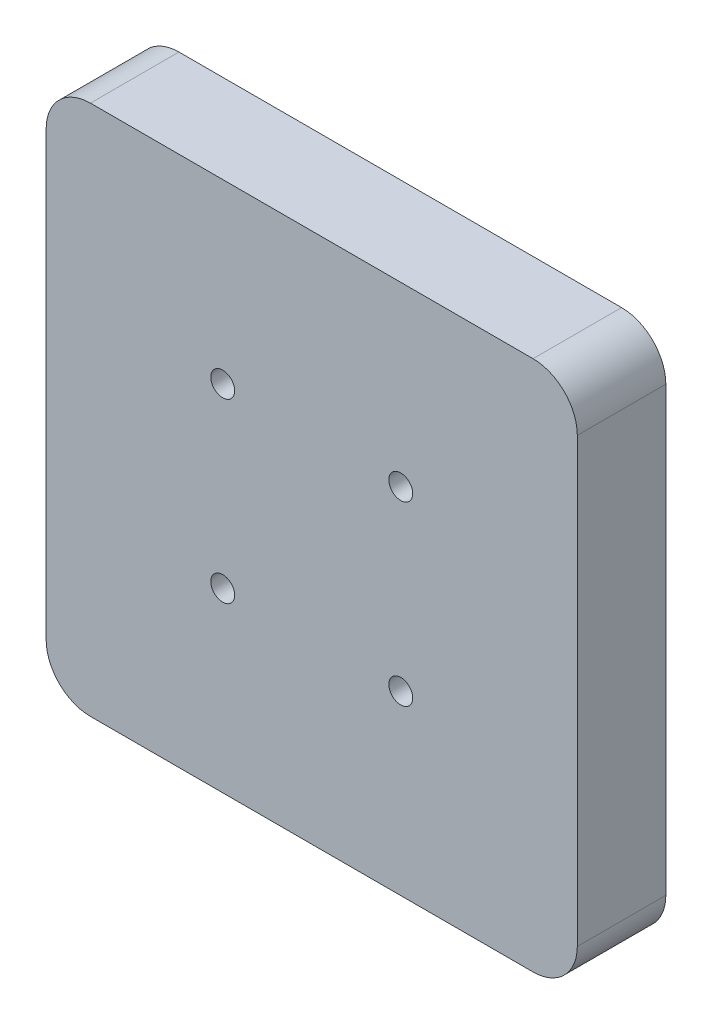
ISO-10303-21;
HEADER;
FILE_DESCRIPTION(('STEP AP214'),'2;1');
FILE_NAME('part.step','',(''),(''),'','','');
FILE_SCHEMA(('AUTOMOTIVE_DESIGN { 1 0 10303 214 1 1 1 1 }'));
ENDSEC;
DATA;
#1=APPLICATION_CONTEXT('core data for automotive mechanical design processes');
#2=APPLICATION_PROTOCOL_DEFINITION('international standard','automotive_design',2000,#1);
#3=PRODUCT_CONTEXT('',#1,'mechanical');
#4=PRODUCT('Part','Part','',(#3));
#5=PRODUCT_RELATED_PRODUCT_CATEGORY('part','',(#4));
#6=PRODUCT_DEFINITION_FORMATION('','',#4);
#7=PRODUCT_DEFINITION_CONTEXT('part definition',#1,'design');
#8=PRODUCT_DEFINITION('design','',#6,#7);
#9=PRODUCT_DEFINITION_SHAPE('','',#8);
#10=(LENGTH_UNIT() NAMED_UNIT(*) SI_UNIT(.MILLI.,.METRE.));
#11=(NAMED_UNIT(*) PLANE_ANGLE_UNIT() SI_UNIT($,.RADIAN.));
#12=(NAMED_UNIT(*) SI_UNIT($,.STERADIAN.) SOLID_ANGLE_UNIT());
#13=UNCERTAINTY_MEASURE_WITH_UNIT(LENGTH_MEASURE(1.E-05),#10,'distance_accuracy_value','');
#14=(GEOMETRIC_REPRESENTATION_CONTEXT(3) GLOBAL_UNCERTAINTY_ASSIGNED_CONTEXT((#13)) GLOBAL_UNIT_ASSIGNED_CONTEXT((#10,
#11,#12)) REPRESENTATION_CONTEXT('',''));
#15=CARTESIAN_POINT('',(0.,0.,0.));
#16=DIRECTION('',(0.,0.,1.));
#17=DIRECTION('',(1.,0.,0.));
#18=AXIS2_PLACEMENT_3D('',#15,#16,#17);
#19=CARTESIAN_POINT('',(0.,0.,0.));
#20=DIRECTION('',(0.,0.,1.));
#21=DIRECTION('',(1.,0.,0.));
#22=AXIS2_PLACEMENT_3D('',#19,#20,#21);
#23=PLANE('',#22);
#24=CARTESIAN_POINT('',(10.113345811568,-73.4041602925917,0.));
#25=DIRECTION('',(0.,0.,1.));
#26=DIRECTION('',(1.,0.,0.));
#27=AXIS2_PLACEMENT_3D('',#24,#25,#26);
#28=CIRCLE('',#27,2.7);
#29=CARTESIAN_POINT('',(12.813345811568,-73.4041602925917,0.));
#30=VERTEX_POINT('',#29);
#31=EDGE_CURVE('E379',#30,#30,#28,.T.);
#32=ORIENTED_EDGE('',*,*,#31,.T.);
#33=EDGE_LOOP('',(#32));
#34=FACE_BOUND('',#33,.T.);
#35=CARTESIAN_POINT('',(10.113345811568,-73.4041602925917,0.));
#36=DIRECTION('',(0.,0.,-1.));
#37=DIRECTION('',(-1.,0.,0.));
#38=AXIS2_PLACEMENT_3D('',#35,#36,#37);
#39=CIRCLE('',#38,5.);
#40=CARTESIAN_POINT('',(5.11334581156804,-73.4041602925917,0.));
#41=VERTEX_POINT('',#40);
#42=EDGE_CURVE('E355',#41,#41,#39,.T.);
#43=ORIENTED_EDGE('',*,*,#42,.T.);
#44=EDGE_LOOP('',(#43));
#45=FACE_BOUND('',#44,.T.);
#46=ADVANCED_FACE('F45',(#34,#45),#23,.F.);
#47=CARTESIAN_POINT('',(-30.1133458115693,-73.4041602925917,0.));
#48=DIRECTION('',(0.,0.,1.));
#49=DIRECTION('',(1.,0.,0.));
#50=AXIS2_PLACEMENT_3D('',#47,#48,#49);
#51=CIRCLE('',#50,2.7);
#52=CARTESIAN_POINT('',(-27.4133458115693,-73.4041602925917,0.));
#53=VERTEX_POINT('',#52);
#54=EDGE_CURVE('E387',#53,#53,#51,.T.);
#55=ORIENTED_EDGE('',*,*,#54,.T.);
#56=EDGE_LOOP('',(#55));
#57=FACE_BOUND('',#56,.T.);
#58=CARTESIAN_POINT('',(-30.1133458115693,-73.4041602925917,0.));
#59=DIRECTION('',(0.,0.,-1.));
#60=DIRECTION('',(-1.,0.,0.));
#61=AXIS2_PLACEMENT_3D('',#58,#59,#60);
#62=CIRCLE('',#61,5.00000000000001);
#63=CARTESIAN_POINT('',(-35.1133458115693,-73.4041602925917,0.));
#64=VERTEX_POINT('',#63);
#65=EDGE_CURVE('E347',#64,#64,#62,.T.);
#66=ORIENTED_EDGE('',*,*,#65,.T.);
#67=EDGE_LOOP('',(#66));
#68=FACE_BOUND('',#67,.T.);
#69=ADVANCED_FACE('F448',(#57,#68),#23,.F.);
#70=CARTESIAN_POINT('',(-30.1133458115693,-113.404160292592,0.));
#71=DIRECTION('',(0.,0.,1.));
#72=DIRECTION('',(1.,0.,0.));
#73=AXIS2_PLACEMENT_3D('',#70,#71,#72);
#74=CIRCLE('',#73,2.70000000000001);
#75=CARTESIAN_POINT('',(-27.4133458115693,-113.404160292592,0.));
#76=VERTEX_POINT('',#75);
#77=EDGE_CURVE('E363',#76,#76,#74,.T.);
#78=ORIENTED_EDGE('',*,*,#77,.T.);
#79=EDGE_LOOP('',(#78));
#80=FACE_BOUND('',#79,.T.);
#81=CARTESIAN_POINT('',(-30.1133458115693,-113.404160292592,0.));
#82=DIRECTION('',(0.,0.,-1.));
#83=DIRECTION('',(-1.,0.,0.));
#84=AXIS2_PLACEMENT_3D('',#81,#82,#83);
#85=CIRCLE('',#84,5.00000000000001);
#86=CARTESIAN_POINT('',(-35.1133458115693,-113.404160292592,0.));
#87=VERTEX_POINT('',#86);
#88=EDGE_CURVE('E339',#87,#87,#85,.T.);
#89=ORIENTED_EDGE('',*,*,#88,.T.);
#90=EDGE_LOOP('',(#89));
#91=FACE_BOUND('',#90,.T.);
#92=ADVANCED_FACE('F456',(#80,#91),#23,.F.);
#93=CARTESIAN_POINT('',(10.1133458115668,-113.404160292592,0.));
#94=DIRECTION('',(0.,0.,1.));
#95=DIRECTION('',(1.,0.,0.));
#96=AXIS2_PLACEMENT_3D('',#93,#94,#95);
#97=CIRCLE('',#96,2.70000000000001);
#98=CARTESIAN_POINT('',(12.8133458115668,-113.404160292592,0.));
#99=VERTEX_POINT('',#98);
#100=EDGE_CURVE('E371',#99,#99,#97,.T.);
#101=ORIENTED_EDGE('',*,*,#100,.T.);
#102=EDGE_LOOP('',(#101));
#103=FACE_BOUND('',#102,.T.);
#104=CARTESIAN_POINT('',(10.1133458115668,-113.404160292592,0.));
#105=DIRECTION('',(0.,0.,-1.));
#106=DIRECTION('',(-1.,0.,0.));
#107=AXIS2_PLACEMENT_3D('',#104,#105,#106);
#108=CIRCLE('',#107,5.);
#109=CARTESIAN_POINT('',(5.11334581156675,-113.404160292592,0.));
#110=VERTEX_POINT('',#109);
#111=EDGE_CURVE('E334',#110,#110,#108,.T.);
#112=ORIENTED_EDGE('',*,*,#111,.T.);
#113=EDGE_LOOP('',(#112));
#114=FACE_BOUND('',#113,.T.);
#115=ADVANCED_FACE('F451',(#103,#114),#23,.F.);
#116=CARTESIAN_POINT('',(0.,0.,6.));
#117=DIRECTION('',(0.,0.,1.));
#118=DIRECTION('',(1.,0.,0.));
#119=AXIS2_PLACEMENT_3D('',#116,#117,#118);
#120=PLANE('',#119);
#121=CARTESIAN_POINT('',(10.1133458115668,-113.404160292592,6.));
#122=DIRECTION('',(0.,0.,1.));
#123=DIRECTION('',(1.,0.,0.));
#124=AXIS2_PLACEMENT_3D('',#121,#122,#123);
#125=CIRCLE('',#124,2.70000000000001);
#126=CARTESIAN_POINT('',(12.8133458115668,-113.404160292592,6.));
#127=VERTEX_POINT('',#126);
#128=EDGE_CURVE('E375',#127,#127,#125,.T.);
#129=ORIENTED_EDGE('',*,*,#128,.F.);
#130=EDGE_LOOP('',(#129));
#131=FACE_BOUND('',#130,.T.);
#132=CARTESIAN_POINT('',(-30.1133458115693,-73.4041602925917,6.));
#133=DIRECTION('',(0.,0.,1.));
#134=DIRECTION('',(1.,0.,0.));
#135=AXIS2_PLACEMENT_3D('',#132,#133,#134);
#136=CIRCLE('',#135,2.7);
#137=CARTESIAN_POINT('',(-27.4133458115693,-73.4041602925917,6.));
#138=VERTEX_POINT('',#137);
#139=EDGE_CURVE('E391',#138,#138,#136,.T.);
#140=ORIENTED_EDGE('',*,*,#139,.F.);
#141=EDGE_LOOP('',(#140));
#142=FACE_BOUND('',#141,.T.);
#143=DIRECTION('',(0.,-1.,0.));
#144=VECTOR('',#143,1.);
#145=CARTESIAN_POINT('',(-70.0000000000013,-33.4041602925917,6.));
#146=LINE('',#145,#144);
#147=CARTESIAN_POINT('',(-70.0000000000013,-43.4041602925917,6.));
#148=VERTEX_POINT('',#147);
#149=CARTESIAN_POINT('',(-70.0000000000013,-143.404160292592,6.));
#150=VERTEX_POINT('',#149);
#151=EDGE_CURVE('E197',#148,#150,#146,.T.);
#152=ORIENTED_EDGE('',*,*,#151,.T.);
#153=CARTESIAN_POINT('',(-60.0000000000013,-143.404160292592,6.));
#154=DIRECTION('',(0.,0.,1.));
#155=DIRECTION('',(1.,0.,0.));
#156=AXIS2_PLACEMENT_3D('',#153,#154,#155);
#157=CIRCLE('',#156,10.);
#158=CARTESIAN_POINT('',(-60.0000000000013,-153.404160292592,6.));
#159=VERTEX_POINT('',#158);
#160=EDGE_CURVE('E261',#150,#159,#157,.T.);
#161=ORIENTED_EDGE('',*,*,#160,.T.);
#162=DIRECTION('',(1.,0.,0.));
#163=VECTOR('',#162,1.);
#164=CARTESIAN_POINT('',(-70.0000000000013,-153.404160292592,6.));
#165=LINE('',#164,#163);
#166=CARTESIAN_POINT('',(39.9999999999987,-153.404160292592,6.));
#167=VERTEX_POINT('',#166);
#168=EDGE_CURVE('E190',#159,#167,#165,.T.);
#169=ORIENTED_EDGE('',*,*,#168,.T.);
#170=CARTESIAN_POINT('',(39.9999999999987,-143.404160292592,6.));
#171=DIRECTION('',(0.,0.,1.));
#172=DIRECTION('',(1.,0.,0.));
#173=AXIS2_PLACEMENT_3D('',#170,#171,#172);
#174=CIRCLE('',#173,10.);
#175=CARTESIAN_POINT('',(49.9999999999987,-143.404160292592,6.));
#176=VERTEX_POINT('',#175);
#177=EDGE_CURVE('E253',#167,#176,#174,.T.);
#178=ORIENTED_EDGE('',*,*,#177,.T.);
#179=DIRECTION('',(0.,1.,0.));
#180=VECTOR('',#179,1.);
#181=CARTESIAN_POINT('',(49.9999999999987,-153.404160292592,6.));
#182=LINE('',#181,#180);
#183=CARTESIAN_POINT('',(49.9999999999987,-43.4041602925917,6.));
#184=VERTEX_POINT('',#183);
#185=EDGE_CURVE('E395',#176,#184,#182,.T.);
#186=ORIENTED_EDGE('',*,*,#185,.T.);
#187=CARTESIAN_POINT('',(39.9999999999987,-43.4041602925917,6.));
#188=DIRECTION('',(0.,0.,1.));
#189=DIRECTION('',(1.,0.,0.));
#190=AXIS2_PLACEMENT_3D('',#187,#188,#189);
#191=CIRCLE('',#190,10.);
#192=CARTESIAN_POINT('',(39.9999999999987,-33.4041602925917,6.));
#193=VERTEX_POINT('',#192);
#194=EDGE_CURVE('E68',#184,#193,#191,.T.);
#195=ORIENTED_EDGE('',*,*,#194,.T.);
#196=DIRECTION('',(-1.,0.,0.));
#197=VECTOR('',#196,1.);
#198=CARTESIAN_POINT('',(49.9999999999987,-33.4041602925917,6.));
#199=LINE('',#198,#197);
#200=CARTESIAN_POINT('',(-60.0000000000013,-33.4041602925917,6.));
#201=VERTEX_POINT('',#200);
#202=EDGE_CURVE('E401',#193,#201,#199,.T.);
#203=ORIENTED_EDGE('',*,*,#202,.T.);
#204=CARTESIAN_POINT('',(-60.0000000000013,-43.4041602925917,6.));
#205=DIRECTION('',(0.,0.,1.));
#206=DIRECTION('',(1.,0.,0.));
#207=AXIS2_PLACEMENT_3D('',#204,#205,#206);
#208=CIRCLE('',#207,10.);
#209=EDGE_CURVE('E258',#201,#148,#208,.T.);
#210=ORIENTED_EDGE('',*,*,#209,.T.);
#211=EDGE_LOOP('',(#152,#161,#169,#178,#186,#195,#203,#210));
#212=FACE_BOUND('',#211,.T.);
#213=CARTESIAN_POINT('',(10.113345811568,-73.4041602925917,6.));
#214=DIRECTION('',(0.,0.,1.));
#215=DIRECTION('',(1.,0.,0.));
#216=AXIS2_PLACEMENT_3D('',#213,#214,#215);
#217=CIRCLE('',#216,2.7);
#218=CARTESIAN_POINT('',(12.813345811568,-73.4041602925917,6.));
#219=VERTEX_POINT('',#218);
#220=EDGE_CURVE('E383',#219,#219,#217,.T.);
#221=ORIENTED_EDGE('',*,*,#220,.F.);
#222=EDGE_LOOP('',(#221));
#223=FACE_BOUND('',#222,.T.);
#224=CARTESIAN_POINT('',(-30.1133458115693,-113.404160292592,6.));
#225=DIRECTION('',(0.,0.,1.));
#226=DIRECTION('',(1.,0.,0.));
#227=AXIS2_PLACEMENT_3D('',#224,#225,#226);
#228=CIRCLE('',#227,2.70000000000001);
#229=CARTESIAN_POINT('',(-27.4133458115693,-113.404160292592,6.));
#230=VERTEX_POINT('',#229);
#231=EDGE_CURVE('E367',#230,#230,#228,.T.);
#232=ORIENTED_EDGE('',*,*,#231,.F.);
#233=EDGE_LOOP('',(#232));
#234=FACE_BOUND('',#233,.T.);
#235=ADVANCED_FACE('F407',(#131,#142,#212,#223,#234),#120,.T.);
#236=CARTESIAN_POINT('',(49.9999999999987,-93.4041602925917,6.));
#237=DIRECTION('',(-1.,0.,0.));
#238=DIRECTION('',(0.,0.,1.));
#239=AXIS2_PLACEMENT_3D('',#236,#237,#238);
#240=PLANE('',#239);
#241=DIRECTION('',(0.,-1.,0.));
#242=VECTOR('',#241,1.);
#243=CARTESIAN_POINT('',(49.9999999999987,-33.4041602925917,-14.));
#244=LINE('',#243,#242);
#245=CARTESIAN_POINT('',(49.9999999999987,-43.4041602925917,-14.));
#246=VERTEX_POINT('',#245);
#247=CARTESIAN_POINT('',(49.9999999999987,-143.404160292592,-14.));
#248=VERTEX_POINT('',#247);
#249=EDGE_CURVE('E330',#246,#248,#244,.T.);
#250=ORIENTED_EDGE('',*,*,#249,.F.);
#251=DIRECTION('',(0.,0.,-1.));
#252=VECTOR('',#251,1.);
#253=CARTESIAN_POINT('',(49.9999999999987,-43.4041602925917,6.));
#254=LINE('',#253,#252);
#255=EDGE_CURVE('E274',#246,#184,#254,.F.);
#256=ORIENTED_EDGE('',*,*,#255,.T.);
#257=ORIENTED_EDGE('',*,*,#185,.F.);
#258=DIRECTION('',(0.,0.,-1.));
#259=VECTOR('',#258,1.);
#260=CARTESIAN_POINT('',(49.9999999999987,-143.404160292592,6.));
#261=LINE('',#260,#259);
#262=EDGE_CURVE('E270',#176,#248,#261,.T.);
#263=ORIENTED_EDGE('',*,*,#262,.T.);
#264=EDGE_LOOP('',(#250,#256,#257,#263));
#265=FACE_BOUND('',#264,.T.);
#266=ADVANCED_FACE('F429',(#265),#240,.F.);
#267=CARTESIAN_POINT('',(49.9999999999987,-33.4041602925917,6.));
#268=DIRECTION('',(0.,-1.,0.));
#269=DIRECTION('',(0.,0.,-1.));
#270=AXIS2_PLACEMENT_3D('',#267,#268,#269);
#271=PLANE('',#270);
#272=DIRECTION('',(1.,0.,0.));
#273=VECTOR('',#272,1.);
#274=CARTESIAN_POINT('',(-70.0000000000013,-33.4041602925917,-14.));
#275=LINE('',#274,#273);
#276=CARTESIAN_POINT('',(-60.0000000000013,-33.4041602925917,-14.));
#277=VERTEX_POINT('',#276);
#278=CARTESIAN_POINT('',(39.9999999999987,-33.4041602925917,-14.));
#279=VERTEX_POINT('',#278);
#280=EDGE_CURVE('E326',#277,#279,#275,.T.);
#281=ORIENTED_EDGE('',*,*,#280,.F.);
#282=DIRECTION('',(0.,0.,-1.));
#283=VECTOR('',#282,1.);
#284=CARTESIAN_POINT('',(-60.0000000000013,-33.4041602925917,6.));
#285=LINE('',#284,#283);
#286=EDGE_CURVE('E61',#277,#201,#285,.F.);
#287=ORIENTED_EDGE('',*,*,#286,.T.);
#288=ORIENTED_EDGE('',*,*,#202,.F.);
#289=DIRECTION('',(0.,0.,-1.));
#290=VECTOR('',#289,1.);
#291=CARTESIAN_POINT('',(39.9999999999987,-33.4041602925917,6.));
#292=LINE('',#291,#290);
#293=EDGE_CURVE('E264',#193,#279,#292,.T.);
#294=ORIENTED_EDGE('',*,*,#293,.T.);
#295=EDGE_LOOP('',(#281,#287,#288,#294));
#296=FACE_BOUND('',#295,.T.);
#297=ADVANCED_FACE('F434',(#296),#271,.F.);
#298=CARTESIAN_POINT('',(-70.0000000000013,-33.4041602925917,6.));
#299=DIRECTION('',(1.,0.,0.));
#300=DIRECTION('',(0.,0.,-1.));
#301=AXIS2_PLACEMENT_3D('',#298,#299,#300);
#302=PLANE('',#301);
#303=DIRECTION('',(0.,1.,0.));
#304=VECTOR('',#303,1.);
#305=CARTESIAN_POINT('',(-70.0000000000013,-153.404160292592,-14.));
#306=LINE('',#305,#304);
#307=CARTESIAN_POINT('',(-70.0000000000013,-143.404160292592,-14.));
#308=VERTEX_POINT('',#307);
#309=CARTESIAN_POINT('',(-70.0000000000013,-43.4041602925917,-14.));
#310=VERTEX_POINT('',#309);
#311=EDGE_CURVE('E321',#308,#310,#306,.T.);
#312=ORIENTED_EDGE('',*,*,#311,.F.);
#313=DIRECTION('',(0.,0.,-1.));
#314=VECTOR('',#313,1.);
#315=CARTESIAN_POINT('',(-70.0000000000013,-143.404160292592,6.));
#316=LINE('',#315,#314);
#317=EDGE_CURVE('E250',#308,#150,#316,.F.);
#318=ORIENTED_EDGE('',*,*,#317,.T.);
#319=ORIENTED_EDGE('',*,*,#151,.F.);
#320=DIRECTION('',(0.,0.,-1.));
#321=VECTOR('',#320,1.);
#322=CARTESIAN_POINT('',(-70.0000000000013,-43.4041602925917,6.));
#323=LINE('',#322,#321);
#324=EDGE_CURVE('E246',#148,#310,#323,.T.);
#325=ORIENTED_EDGE('',*,*,#324,.T.);
#326=EDGE_LOOP('',(#312,#318,#319,#325));
#327=FACE_BOUND('',#326,.T.);
#328=ADVANCED_FACE('F437',(#327),#302,.F.);
#329=CARTESIAN_POINT('',(-70.0000000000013,-153.404160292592,6.));
#330=DIRECTION('',(0.,1.,0.));
#331=DIRECTION('',(0.,0.,1.));
#332=AXIS2_PLACEMENT_3D('',#329,#330,#331);
#333=PLANE('',#332);
#334=ORIENTED_EDGE('',*,*,#168,.F.);
#335=DIRECTION('',(0.,0.,-1.));
#336=VECTOR('',#335,1.);
#337=CARTESIAN_POINT('',(-60.0000000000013,-153.404160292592,6.));
#338=LINE('',#337,#336);
#339=CARTESIAN_POINT('',(-60.0000000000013,-153.404160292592,-14.));
#340=VERTEX_POINT('',#339);
#341=EDGE_CURVE('E230',#159,#340,#338,.T.);
#342=ORIENTED_EDGE('',*,*,#341,.T.);
#343=DIRECTION('',(-1.,0.,0.));
#344=VECTOR('',#343,1.);
#345=CARTESIAN_POINT('',(49.9999999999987,-153.404160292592,-14.));
#346=LINE('',#345,#344);
#347=CARTESIAN_POINT('',(39.9999999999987,-153.404160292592,-14.));
#348=VERTEX_POINT('',#347);
#349=EDGE_CURVE('E317',#348,#340,#346,.T.);
#350=ORIENTED_EDGE('',*,*,#349,.F.);
#351=DIRECTION('',(0.,0.,-1.));
#352=VECTOR('',#351,1.);
#353=CARTESIAN_POINT('',(39.9999999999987,-153.404160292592,6.));
#354=LINE('',#353,#352);
#355=EDGE_CURVE('E227',#348,#167,#354,.F.);
#356=ORIENTED_EDGE('',*,*,#355,.T.);
#357=EDGE_LOOP('',(#334,#342,#350,#356));
#358=FACE_BOUND('',#357,.T.);
#359=ADVANCED_FACE('F419',(#358),#333,.F.);
#360=CARTESIAN_POINT('',(-30.1133458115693,-73.4041602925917,6.));
#361=DIRECTION('',(0.,0.,-1.));
#362=DIRECTION('',(-1.,0.,0.));
#363=AXIS2_PLACEMENT_3D('',#360,#361,#362);
#364=CYLINDRICAL_SURFACE('',#363,2.7);
#365=ORIENTED_EDGE('',*,*,#139,.T.);
#366=EDGE_LOOP('',(#365));
#367=FACE_BOUND('',#366,.T.);
#368=ORIENTED_EDGE('',*,*,#54,.F.);
#369=EDGE_LOOP('',(#368));
#370=FACE_BOUND('',#369,.T.);
#371=ADVANCED_FACE('F444',(#367,#370),#364,.F.);
#372=CARTESIAN_POINT('',(10.113345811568,-73.4041602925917,6.));
#373=DIRECTION('',(0.,0.,-1.));
#374=DIRECTION('',(-1.,0.,0.));
#375=AXIS2_PLACEMENT_3D('',#372,#373,#374);
#376=CYLINDRICAL_SURFACE('',#375,2.7);
#377=ORIENTED_EDGE('',*,*,#220,.T.);
#378=EDGE_LOOP('',(#377));
#379=FACE_BOUND('',#378,.T.);
#380=ORIENTED_EDGE('',*,*,#31,.F.);
#381=EDGE_LOOP('',(#380));
#382=FACE_BOUND('',#381,.T.);
#383=ADVANCED_FACE('F502',(#379,#382),#376,.F.);
#384=CARTESIAN_POINT('',(10.1133458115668,-113.404160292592,6.));
#385=DIRECTION('',(0.,0.,-1.));
#386=DIRECTION('',(-1.,0.,0.));
#387=AXIS2_PLACEMENT_3D('',#384,#385,#386);
#388=CYLINDRICAL_SURFACE('',#387,2.70000000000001);
#389=ORIENTED_EDGE('',*,*,#128,.T.);
#390=EDGE_LOOP('',(#389));
#391=FACE_BOUND('',#390,.T.);
#392=ORIENTED_EDGE('',*,*,#100,.F.);
#393=EDGE_LOOP('',(#392));
#394=FACE_BOUND('',#393,.T.);
#395=ADVANCED_FACE('F498',(#391,#394),#388,.F.);
#396=CARTESIAN_POINT('',(-30.1133458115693,-113.404160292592,6.));
#397=DIRECTION('',(0.,0.,-1.));
#398=DIRECTION('',(-1.,0.,0.));
#399=AXIS2_PLACEMENT_3D('',#396,#397,#398);
#400=CYLINDRICAL_SURFACE('',#399,2.70000000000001);
#401=ORIENTED_EDGE('',*,*,#231,.T.);
#402=EDGE_LOOP('',(#401));
#403=FACE_BOUND('',#402,.T.);
#404=ORIENTED_EDGE('',*,*,#77,.F.);
#405=EDGE_LOOP('',(#404));
#406=FACE_BOUND('',#405,.T.);
#407=ADVANCED_FACE('F496',(#403,#406),#400,.F.);
#408=CARTESIAN_POINT('',(0.,0.,-4.));
#409=DIRECTION('',(0.,0.,-1.));
#410=DIRECTION('',(-1.,0.,0.));
#411=AXIS2_PLACEMENT_3D('',#408,#409,#410);
#412=PLANE('',#411);
#413=DIRECTION('',(0.,-1.,0.));
#414=VECTOR('',#413,1.);
#415=CARTESIAN_POINT('',(44.9999999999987,-38.4041602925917,-4.));
#416=LINE('',#415,#414);
#417=CARTESIAN_POINT('',(44.9999999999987,-48.4041602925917,-4.));
#418=VERTEX_POINT('',#417);
#419=CARTESIAN_POINT('',(44.9999999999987,-138.404160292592,-4.));
#420=VERTEX_POINT('',#419);
#421=EDGE_CURVE('E164',#418,#420,#416,.T.);
#422=ORIENTED_EDGE('',*,*,#421,.T.);
#423=CARTESIAN_POINT('',(34.9999999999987,-138.404160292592,-4.));
#424=DIRECTION('',(0.,0.,-1.));
#425=DIRECTION('',(-1.,0.,0.));
#426=AXIS2_PLACEMENT_3D('',#423,#424,#425);
#427=CIRCLE('',#426,10.);
#428=CARTESIAN_POINT('',(34.9999999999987,-148.404160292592,-4.));
#429=VERTEX_POINT('',#428);
#430=EDGE_CURVE('E172',#420,#429,#427,.T.);
#431=ORIENTED_EDGE('',*,*,#430,.T.);
#432=DIRECTION('',(-1.,0.,0.));
#433=VECTOR('',#432,1.);
#434=CARTESIAN_POINT('',(44.9999999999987,-148.404160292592,-4.));
#435=LINE('',#434,#433);
#436=CARTESIAN_POINT('',(-55.0000000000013,-148.404160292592,-4.));
#437=VERTEX_POINT('',#436);
#438=EDGE_CURVE('E305',#429,#437,#435,.T.);
#439=ORIENTED_EDGE('',*,*,#438,.T.);
#440=CARTESIAN_POINT('',(-55.0000000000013,-138.404160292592,-4.));
#441=DIRECTION('',(0.,0.,-1.));
#442=DIRECTION('',(-1.,0.,0.));
#443=AXIS2_PLACEMENT_3D('',#440,#441,#442);
#444=CIRCLE('',#443,10.);
#445=CARTESIAN_POINT('',(-65.0000000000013,-138.404160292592,-4.));
#446=VERTEX_POINT('',#445);
#447=EDGE_CURVE('E173',#437,#446,#444,.T.);
#448=ORIENTED_EDGE('',*,*,#447,.T.);
#449=DIRECTION('',(0.,1.,0.));
#450=VECTOR('',#449,1.);
#451=CARTESIAN_POINT('',(-65.0000000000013,-148.404160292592,-4.));
#452=LINE('',#451,#450);
#453=CARTESIAN_POINT('',(-65.0000000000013,-48.4041602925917,-4.));
#454=VERTEX_POINT('',#453);
#455=EDGE_CURVE('E304',#446,#454,#452,.T.);
#456=ORIENTED_EDGE('',*,*,#455,.T.);
#457=CARTESIAN_POINT('',(-55.0000000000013,-48.4041602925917,-4.));
#458=DIRECTION('',(0.,0.,-1.));
#459=DIRECTION('',(-1.,0.,0.));
#460=AXIS2_PLACEMENT_3D('',#457,#458,#459);
#461=CIRCLE('',#460,10.);
#462=CARTESIAN_POINT('',(-55.0000000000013,-38.4041602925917,-4.));
#463=VERTEX_POINT('',#462);
#464=EDGE_CURVE('E194',#454,#463,#461,.T.);
#465=ORIENTED_EDGE('',*,*,#464,.T.);
#466=DIRECTION('',(1.,0.,0.));
#467=VECTOR('',#466,1.);
#468=CARTESIAN_POINT('',(-65.0000000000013,-38.4041602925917,-4.));
#469=LINE('',#468,#467);
#470=CARTESIAN_POINT('',(34.9999999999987,-38.4041602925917,-4.));
#471=VERTEX_POINT('',#470);
#472=EDGE_CURVE('E166',#463,#471,#469,.T.);
#473=ORIENTED_EDGE('',*,*,#472,.T.);
#474=CARTESIAN_POINT('',(34.9999999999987,-48.4041602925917,-4.));
#475=DIRECTION('',(0.,0.,-1.));
#476=DIRECTION('',(-1.,0.,0.));
#477=AXIS2_PLACEMENT_3D('',#474,#475,#476);
#478=CIRCLE('',#477,10.);
#479=EDGE_CURVE('E160',#471,#418,#478,.T.);
#480=ORIENTED_EDGE('',*,*,#479,.T.);
#481=EDGE_LOOP('',(#422,#431,#439,#448,#456,#465,#473,#480));
#482=FACE_BOUND('',#481,.T.);
#483=CARTESIAN_POINT('',(-30.1133458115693,-113.404160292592,-4.));
#484=DIRECTION('',(0.,0.,-1.));
#485=DIRECTION('',(-1.,0.,0.));
#486=AXIS2_PLACEMENT_3D('',#483,#484,#485);
#487=CIRCLE('',#486,5.00000000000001);
#488=CARTESIAN_POINT('',(-35.1133458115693,-113.404160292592,-4.));
#489=VERTEX_POINT('',#488);
#490=EDGE_CURVE('E343',#489,#489,#487,.T.);
#491=ORIENTED_EDGE('',*,*,#490,.F.);
#492=EDGE_LOOP('',(#491));
#493=FACE_BOUND('',#492,.T.);
#494=CARTESIAN_POINT('',(10.113345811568,-73.4041602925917,-4.));
#495=DIRECTION('',(0.,0.,-1.));
#496=DIRECTION('',(-1.,0.,0.));
#497=AXIS2_PLACEMENT_3D('',#494,#495,#496);
#498=CIRCLE('',#497,5.);
#499=CARTESIAN_POINT('',(5.11334581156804,-73.4041602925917,-4.));
#500=VERTEX_POINT('',#499);
#501=EDGE_CURVE('E359',#500,#500,#498,.T.);
#502=ORIENTED_EDGE('',*,*,#501,.F.);
#503=EDGE_LOOP('',(#502));
#504=FACE_BOUND('',#503,.T.);
#505=CARTESIAN_POINT('',(-30.1133458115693,-73.4041602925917,-4.));
#506=DIRECTION('',(0.,0.,-1.));
#507=DIRECTION('',(-1.,0.,0.));
#508=AXIS2_PLACEMENT_3D('',#505,#506,#507);
#509=CIRCLE('',#508,5.00000000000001);
#510=CARTESIAN_POINT('',(-35.1133458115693,-73.4041602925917,-4.));
#511=VERTEX_POINT('',#510);
#512=EDGE_CURVE('E351',#511,#511,#509,.T.);
#513=ORIENTED_EDGE('',*,*,#512,.F.);
#514=EDGE_LOOP('',(#513));
#515=FACE_BOUND('',#514,.T.);
#516=CARTESIAN_POINT('',(10.1133458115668,-113.404160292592,-4.));
#517=DIRECTION('',(0.,0.,-1.));
#518=DIRECTION('',(-1.,0.,0.));
#519=AXIS2_PLACEMENT_3D('',#516,#517,#518);
#520=CIRCLE('',#519,5.);
#521=CARTESIAN_POINT('',(5.11334581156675,-113.404160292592,-4.));
#522=VERTEX_POINT('',#521);
#523=EDGE_CURVE('E335',#522,#522,#520,.T.);
#524=ORIENTED_EDGE('',*,*,#523,.F.);
#525=EDGE_LOOP('',(#524));
#526=FACE_BOUND('',#525,.T.);
#527=ADVANCED_FACE('F162',(#482,#493,#504,#515,#526),#412,.T.);
#528=CARTESIAN_POINT('',(10.113345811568,-73.4041602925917,-4.));
#529=DIRECTION('',(0.,0.,1.));
#530=DIRECTION('',(1.,0.,0.));
#531=AXIS2_PLACEMENT_3D('',#528,#529,#530);
#532=CYLINDRICAL_SURFACE('',#531,5.);
#533=ORIENTED_EDGE('',*,*,#501,.T.);
#534=EDGE_LOOP('',(#533));
#535=FACE_BOUND('',#534,.T.);
#536=ORIENTED_EDGE('',*,*,#42,.F.);
#537=EDGE_LOOP('',(#536));
#538=FACE_BOUND('',#537,.T.);
#539=ADVANCED_FACE('F490',(#535,#538),#532,.F.);
#540=CARTESIAN_POINT('',(-30.1133458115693,-73.4041602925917,-4.));
#541=DIRECTION('',(0.,0.,1.));
#542=DIRECTION('',(1.,0.,0.));
#543=AXIS2_PLACEMENT_3D('',#540,#541,#542);
#544=CYLINDRICAL_SURFACE('',#543,5.00000000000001);
#545=ORIENTED_EDGE('',*,*,#512,.T.);
#546=EDGE_LOOP('',(#545));
#547=FACE_BOUND('',#546,.T.);
#548=ORIENTED_EDGE('',*,*,#65,.F.);
#549=EDGE_LOOP('',(#548));
#550=FACE_BOUND('',#549,.T.);
#551=ADVANCED_FACE('F483',(#547,#550),#544,.F.);
#552=CARTESIAN_POINT('',(-30.1133458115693,-113.404160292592,-4.));
#553=DIRECTION('',(0.,0.,1.));
#554=DIRECTION('',(1.,0.,0.));
#555=AXIS2_PLACEMENT_3D('',#552,#553,#554);
#556=CYLINDRICAL_SURFACE('',#555,5.00000000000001);
#557=ORIENTED_EDGE('',*,*,#490,.T.);
#558=EDGE_LOOP('',(#557));
#559=FACE_BOUND('',#558,.T.);
#560=ORIENTED_EDGE('',*,*,#88,.F.);
#561=EDGE_LOOP('',(#560));
#562=FACE_BOUND('',#561,.T.);
#563=ADVANCED_FACE('F475',(#559,#562),#556,.F.);
#564=CARTESIAN_POINT('',(10.1133458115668,-113.404160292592,-4.));
#565=DIRECTION('',(0.,0.,1.));
#566=DIRECTION('',(1.,0.,0.));
#567=AXIS2_PLACEMENT_3D('',#564,#565,#566);
#568=CYLINDRICAL_SURFACE('',#567,5.);
#569=ORIENTED_EDGE('',*,*,#523,.T.);
#570=EDGE_LOOP('',(#569));
#571=FACE_BOUND('',#570,.T.);
#572=ORIENTED_EDGE('',*,*,#111,.F.);
#573=EDGE_LOOP('',(#572));
#574=FACE_BOUND('',#573,.T.);
#575=ADVANCED_FACE('F473',(#571,#574),#568,.F.);
#576=CARTESIAN_POINT('',(0.,0.,-14.));
#577=DIRECTION('',(0.,0.,-1.));
#578=DIRECTION('',(-1.,0.,0.));
#579=AXIS2_PLACEMENT_3D('',#576,#577,#578);
#580=PLANE('',#579);
#581=ORIENTED_EDGE('',*,*,#349,.T.);
#582=CARTESIAN_POINT('',(-60.0000000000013,-143.404160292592,-14.));
#583=DIRECTION('',(0.,0.,-1.));
#584=DIRECTION('',(-1.,0.,0.));
#585=AXIS2_PLACEMENT_3D('',#582,#583,#584);
#586=CIRCLE('',#585,10.);
#587=EDGE_CURVE('E243',#340,#308,#586,.T.);
#588=ORIENTED_EDGE('',*,*,#587,.T.);
#589=ORIENTED_EDGE('',*,*,#311,.T.);
#590=CARTESIAN_POINT('',(-60.0000000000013,-43.4041602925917,-14.));
#591=DIRECTION('',(0.,0.,-1.));
#592=DIRECTION('',(-1.,0.,0.));
#593=AXIS2_PLACEMENT_3D('',#590,#591,#592);
#594=CIRCLE('',#593,10.);
#595=EDGE_CURVE('E240',#310,#277,#594,.T.);
#596=ORIENTED_EDGE('',*,*,#595,.T.);
#597=ORIENTED_EDGE('',*,*,#280,.T.);
#598=CARTESIAN_POINT('',(39.9999999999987,-43.4041602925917,-14.));
#599=DIRECTION('',(0.,0.,-1.));
#600=DIRECTION('',(-1.,0.,0.));
#601=AXIS2_PLACEMENT_3D('',#598,#599,#600);
#602=CIRCLE('',#601,10.);
#603=EDGE_CURVE('E237',#279,#246,#602,.T.);
#604=ORIENTED_EDGE('',*,*,#603,.T.);
#605=ORIENTED_EDGE('',*,*,#249,.T.);
#606=CARTESIAN_POINT('',(39.9999999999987,-143.404160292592,-14.));
#607=DIRECTION('',(0.,0.,-1.));
#608=DIRECTION('',(-1.,0.,0.));
#609=AXIS2_PLACEMENT_3D('',#606,#607,#608);
#610=CIRCLE('',#609,10.);
#611=EDGE_CURVE('E234',#248,#348,#610,.T.);
#612=ORIENTED_EDGE('',*,*,#611,.T.);
#613=EDGE_LOOP('',(#581,#588,#589,#596,#597,#604,#605,#612));
#614=FACE_BOUND('',#613,.T.);
#615=DIRECTION('',(0.,1.,0.));
#616=VECTOR('',#615,1.);
#617=CARTESIAN_POINT('',(-65.0000000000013,-148.404160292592,-14.));
#618=LINE('',#617,#616);
#619=CARTESIAN_POINT('',(-65.0000000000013,-138.404160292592,-14.));
#620=VERTEX_POINT('',#619);
#621=CARTESIAN_POINT('',(-65.0000000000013,-48.4041602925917,-14.));
#622=VERTEX_POINT('',#621);
#623=EDGE_CURVE('E290',#620,#622,#618,.T.);
#624=ORIENTED_EDGE('',*,*,#623,.F.);
#625=CARTESIAN_POINT('',(-55.0000000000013,-138.404160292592,-14.));
#626=DIRECTION('',(0.,0.,-1.));
#627=DIRECTION('',(-1.,0.,0.));
#628=AXIS2_PLACEMENT_3D('',#625,#626,#627);
#629=CIRCLE('',#628,10.);
#630=CARTESIAN_POINT('',(-55.0000000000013,-148.404160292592,-14.));
#631=VERTEX_POINT('',#630);
#632=EDGE_CURVE('E54',#620,#631,#629,.F.);
#633=ORIENTED_EDGE('',*,*,#632,.T.);
#634=DIRECTION('',(-1.,0.,0.));
#635=VECTOR('',#634,1.);
#636=CARTESIAN_POINT('',(44.9999999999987,-148.404160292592,-14.));
#637=LINE('',#636,#635);
#638=CARTESIAN_POINT('',(34.9999999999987,-148.404160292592,-14.));
#639=VERTEX_POINT('',#638);
#640=EDGE_CURVE('E184',#639,#631,#637,.T.);
#641=ORIENTED_EDGE('',*,*,#640,.F.);
#642=CARTESIAN_POINT('',(34.9999999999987,-138.404160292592,-14.));
#643=DIRECTION('',(0.,0.,-1.));
#644=DIRECTION('',(-1.,0.,0.));
#645=AXIS2_PLACEMENT_3D('',#642,#643,#644);
#646=CIRCLE('',#645,10.);
#647=CARTESIAN_POINT('',(44.9999999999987,-138.404160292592,-14.));
#648=VERTEX_POINT('',#647);
#649=EDGE_CURVE('E277',#639,#648,#646,.F.);
#650=ORIENTED_EDGE('',*,*,#649,.T.);
#651=DIRECTION('',(0.,-1.,0.));
#652=VECTOR('',#651,1.);
#653=CARTESIAN_POINT('',(44.9999999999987,-38.4041602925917,-14.));
#654=LINE('',#653,#652);
#655=CARTESIAN_POINT('',(44.9999999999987,-48.4041602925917,-14.));
#656=VERTEX_POINT('',#655);
#657=EDGE_CURVE('E322',#656,#648,#654,.T.);
#658=ORIENTED_EDGE('',*,*,#657,.F.);
#659=CARTESIAN_POINT('',(34.9999999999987,-48.4041602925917,-14.));
#660=DIRECTION('',(0.,0.,-1.));
#661=DIRECTION('',(-1.,0.,0.));
#662=AXIS2_PLACEMENT_3D('',#659,#660,#661);
#663=CIRCLE('',#662,10.);
#664=CARTESIAN_POINT('',(34.9999999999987,-38.4041602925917,-14.));
#665=VERTEX_POINT('',#664);
#666=EDGE_CURVE('E188',#656,#665,#663,.F.);
#667=ORIENTED_EDGE('',*,*,#666,.T.);
#668=DIRECTION('',(1.,0.,0.));
#669=VECTOR('',#668,1.);
#670=CARTESIAN_POINT('',(-65.0000000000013,-38.4041602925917,-14.));
#671=LINE('',#670,#669);
#672=CARTESIAN_POINT('',(-55.0000000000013,-38.4041602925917,-14.));
#673=VERTEX_POINT('',#672);
#674=EDGE_CURVE('E736',#673,#665,#671,.T.);
#675=ORIENTED_EDGE('',*,*,#674,.F.);
#676=CARTESIAN_POINT('',(-55.0000000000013,-48.4041602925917,-14.));
#677=DIRECTION('',(0.,0.,-1.));
#678=DIRECTION('',(-1.,0.,0.));
#679=AXIS2_PLACEMENT_3D('',#676,#677,#678);
#680=CIRCLE('',#679,10.);
#681=EDGE_CURVE('E11',#673,#622,#680,.F.);
#682=ORIENTED_EDGE('',*,*,#681,.T.);
#683=EDGE_LOOP('',(#624,#633,#641,#650,#658,#667,#675,#682));
#684=FACE_BOUND('',#683,.T.);
#685=ADVANCED_FACE('F287',(#614,#684),#580,.T.);
#686=CARTESIAN_POINT('',(44.9999999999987,-148.404160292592,-14.));
#687=DIRECTION('',(0.,1.,0.));
#688=DIRECTION('',(0.,0.,1.));
#689=AXIS2_PLACEMENT_3D('',#686,#687,#688);
#690=PLANE('',#689);
#691=ORIENTED_EDGE('',*,*,#438,.F.);
#692=DIRECTION('',(0.,0.,1.));
#693=VECTOR('',#692,1.);
#694=CARTESIAN_POINT('',(34.9999999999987,-148.404160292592,-14.));
#695=LINE('',#694,#693);
#696=EDGE_CURVE('E211',#429,#639,#695,.F.);
#697=ORIENTED_EDGE('',*,*,#696,.T.);
#698=ORIENTED_EDGE('',*,*,#640,.T.);
#699=DIRECTION('',(0.,0.,1.));
#700=VECTOR('',#699,1.);
#701=CARTESIAN_POINT('',(-55.0000000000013,-148.404160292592,-4.));
#702=LINE('',#701,#700);
#703=EDGE_CURVE('E207',#631,#437,#702,.T.);
#704=ORIENTED_EDGE('',*,*,#703,.T.);
#705=EDGE_LOOP('',(#691,#697,#698,#704));
#706=FACE_BOUND('',#705,.T.);
#707=ADVANCED_FACE('F296',(#706),#690,.T.);
#708=CARTESIAN_POINT('',(-65.0000000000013,-148.404160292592,-14.));
#709=DIRECTION('',(1.,0.,0.));
#710=DIRECTION('',(0.,0.,-1.));
#711=AXIS2_PLACEMENT_3D('',#708,#709,#710);
#712=PLANE('',#711);
#713=ORIENTED_EDGE('',*,*,#455,.F.);
#714=DIRECTION('',(0.,0.,1.));
#715=VECTOR('',#714,1.);
#716=CARTESIAN_POINT('',(-65.0000000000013,-138.404160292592,-14.));
#717=LINE('',#716,#715);
#718=EDGE_CURVE('E224',#446,#620,#717,.F.);
#719=ORIENTED_EDGE('',*,*,#718,.T.);
#720=ORIENTED_EDGE('',*,*,#623,.T.);
#721=DIRECTION('',(0.,0.,1.));
#722=VECTOR('',#721,1.);
#723=CARTESIAN_POINT('',(-65.0000000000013,-48.4041602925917,-4.));
#724=LINE('',#723,#722);
#725=EDGE_CURVE('E220',#622,#454,#724,.T.);
#726=ORIENTED_EDGE('',*,*,#725,.T.);
#727=EDGE_LOOP('',(#713,#719,#720,#726));
#728=FACE_BOUND('',#727,.T.);
#729=ADVANCED_FACE('F307',(#728),#712,.T.);
#730=CARTESIAN_POINT('',(-65.0000000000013,-38.4041602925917,-14.));
#731=DIRECTION('',(0.,-1.,0.));
#732=DIRECTION('',(0.,0.,-1.));
#733=AXIS2_PLACEMENT_3D('',#730,#731,#732);
#734=PLANE('',#733);
#735=ORIENTED_EDGE('',*,*,#674,.T.);
#736=DIRECTION('',(0.,0.,1.));
#737=VECTOR('',#736,1.);
#738=CARTESIAN_POINT('',(34.9999999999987,-38.4041602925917,-4.));
#739=LINE('',#738,#737);
#740=EDGE_CURVE('E217',#665,#471,#739,.T.);
#741=ORIENTED_EDGE('',*,*,#740,.T.);
#742=ORIENTED_EDGE('',*,*,#472,.F.);
#743=DIRECTION('',(0.,0.,1.));
#744=VECTOR('',#743,1.);
#745=CARTESIAN_POINT('',(-55.0000000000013,-38.4041602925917,-14.));
#746=LINE('',#745,#744);
#747=EDGE_CURVE('E214',#463,#673,#746,.F.);
#748=ORIENTED_EDGE('',*,*,#747,.T.);
#749=EDGE_LOOP('',(#735,#741,#742,#748));
#750=FACE_BOUND('',#749,.T.);
#751=ADVANCED_FACE('F643',(#750),#734,.T.);
#752=CARTESIAN_POINT('',(44.9999999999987,-38.4041602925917,-14.));
#753=DIRECTION('',(-1.,0.,0.));
#754=DIRECTION('',(0.,0.,1.));
#755=AXIS2_PLACEMENT_3D('',#752,#753,#754);
#756=PLANE('',#755);
#757=ORIENTED_EDGE('',*,*,#657,.T.);
#758=DIRECTION('',(0.,0.,1.));
#759=VECTOR('',#758,1.);
#760=CARTESIAN_POINT('',(44.9999999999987,-138.404160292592,-4.));
#761=LINE('',#760,#759);
#762=EDGE_CURVE('E182',#648,#420,#761,.T.);
#763=ORIENTED_EDGE('',*,*,#762,.T.);
#764=ORIENTED_EDGE('',*,*,#421,.F.);
#765=DIRECTION('',(0.,0.,1.));
#766=VECTOR('',#765,1.);
#767=CARTESIAN_POINT('',(44.9999999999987,-48.4041602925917,-14.));
#768=LINE('',#767,#766);
#769=EDGE_CURVE('E179',#418,#656,#768,.F.);
#770=ORIENTED_EDGE('',*,*,#769,.T.);
#771=EDGE_LOOP('',(#757,#763,#764,#770));
#772=FACE_BOUND('',#771,.T.);
#773=ADVANCED_FACE('F178',(#772),#756,.T.);
#774=CARTESIAN_POINT('',(34.9999999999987,-138.404160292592,-14.));
#775=DIRECTION('',(0.,0.,-1.));
#776=DIRECTION('',(-1.,0.,0.));
#777=AXIS2_PLACEMENT_3D('',#774,#775,#776);
#778=CYLINDRICAL_SURFACE('',#777,10.);
#779=ORIENTED_EDGE('',*,*,#649,.F.);
#780=ORIENTED_EDGE('',*,*,#696,.F.);
#781=ORIENTED_EDGE('',*,*,#430,.F.);
#782=ORIENTED_EDGE('',*,*,#762,.F.);
#783=EDGE_LOOP('',(#779,#780,#781,#782));
#784=FACE_BOUND('',#783,.T.);
#785=ADVANCED_FACE('F659',(#784),#778,.F.);
#786=CARTESIAN_POINT('',(34.9999999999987,-48.4041602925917,-14.));
#787=DIRECTION('',(0.,0.,-1.));
#788=DIRECTION('',(-1.,0.,0.));
#789=AXIS2_PLACEMENT_3D('',#786,#787,#788);
#790=CYLINDRICAL_SURFACE('',#789,10.);
#791=ORIENTED_EDGE('',*,*,#666,.F.);
#792=ORIENTED_EDGE('',*,*,#769,.F.);
#793=ORIENTED_EDGE('',*,*,#479,.F.);
#794=ORIENTED_EDGE('',*,*,#740,.F.);
#795=EDGE_LOOP('',(#791,#792,#793,#794));
#796=FACE_BOUND('',#795,.T.);
#797=ADVANCED_FACE('F187',(#796),#790,.F.);
#798=CARTESIAN_POINT('',(-55.0000000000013,-138.404160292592,-14.));
#799=DIRECTION('',(0.,0.,-1.));
#800=DIRECTION('',(-1.,0.,0.));
#801=AXIS2_PLACEMENT_3D('',#798,#799,#800);
#802=CYLINDRICAL_SURFACE('',#801,10.);
#803=ORIENTED_EDGE('',*,*,#632,.F.);
#804=ORIENTED_EDGE('',*,*,#718,.F.);
#805=ORIENTED_EDGE('',*,*,#447,.F.);
#806=ORIENTED_EDGE('',*,*,#703,.F.);
#807=EDGE_LOOP('',(#803,#804,#805,#806));
#808=FACE_BOUND('',#807,.T.);
#809=ADVANCED_FACE('F301',(#808),#802,.F.);
#810=CARTESIAN_POINT('',(-55.0000000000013,-48.4041602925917,-14.));
#811=DIRECTION('',(0.,0.,-1.));
#812=DIRECTION('',(-1.,0.,0.));
#813=AXIS2_PLACEMENT_3D('',#810,#811,#812);
#814=CYLINDRICAL_SURFACE('',#813,10.);
#815=ORIENTED_EDGE('',*,*,#681,.F.);
#816=ORIENTED_EDGE('',*,*,#747,.F.);
#817=ORIENTED_EDGE('',*,*,#464,.F.);
#818=ORIENTED_EDGE('',*,*,#725,.F.);
#819=EDGE_LOOP('',(#815,#816,#817,#818));
#820=FACE_BOUND('',#819,.T.);
#821=ADVANCED_FACE('F682',(#820),#814,.F.);
#822=CARTESIAN_POINT('',(-60.0000000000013,-143.404160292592,6.));
#823=DIRECTION('',(0.,0.,-1.));
#824=DIRECTION('',(-1.,0.,0.));
#825=AXIS2_PLACEMENT_3D('',#822,#823,#824);
#826=CYLINDRICAL_SURFACE('',#825,10.);
#827=ORIENTED_EDGE('',*,*,#160,.F.);
#828=ORIENTED_EDGE('',*,*,#317,.F.);
#829=ORIENTED_EDGE('',*,*,#587,.F.);
#830=ORIENTED_EDGE('',*,*,#341,.F.);
#831=EDGE_LOOP('',(#827,#828,#829,#830));
#832=FACE_BOUND('',#831,.T.);
#833=ADVANCED_FACE('F416',(#832),#826,.T.);
#834=CARTESIAN_POINT('',(-60.0000000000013,-43.4041602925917,6.));
#835=DIRECTION('',(0.,0.,-1.));
#836=DIRECTION('',(-1.,0.,0.));
#837=AXIS2_PLACEMENT_3D('',#834,#835,#836);
#838=CYLINDRICAL_SURFACE('',#837,10.);
#839=ORIENTED_EDGE('',*,*,#209,.F.);
#840=ORIENTED_EDGE('',*,*,#286,.F.);
#841=ORIENTED_EDGE('',*,*,#595,.F.);
#842=ORIENTED_EDGE('',*,*,#324,.F.);
#843=EDGE_LOOP('',(#839,#840,#841,#842));
#844=FACE_BOUND('',#843,.T.);
#845=ADVANCED_FACE('F436',(#844),#838,.T.);
#846=CARTESIAN_POINT('',(39.9999999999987,-43.4041602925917,6.));
#847=DIRECTION('',(0.,0.,-1.));
#848=DIRECTION('',(-1.,0.,0.));
#849=AXIS2_PLACEMENT_3D('',#846,#847,#848);
#850=CYLINDRICAL_SURFACE('',#849,10.);
#851=ORIENTED_EDGE('',*,*,#194,.F.);
#852=ORIENTED_EDGE('',*,*,#255,.F.);
#853=ORIENTED_EDGE('',*,*,#603,.F.);
#854=ORIENTED_EDGE('',*,*,#293,.F.);
#855=EDGE_LOOP('',(#851,#852,#853,#854));
#856=FACE_BOUND('',#855,.T.);
#857=ADVANCED_FACE('F433',(#856),#850,.T.);
#858=CARTESIAN_POINT('',(39.9999999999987,-143.404160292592,6.));
#859=DIRECTION('',(0.,0.,-1.));
#860=DIRECTION('',(-1.,0.,0.));
#861=AXIS2_PLACEMENT_3D('',#858,#859,#860);
#862=CYLINDRICAL_SURFACE('',#861,10.);
#863=ORIENTED_EDGE('',*,*,#177,.F.);
#864=ORIENTED_EDGE('',*,*,#355,.F.);
#865=ORIENTED_EDGE('',*,*,#611,.F.);
#866=ORIENTED_EDGE('',*,*,#262,.F.);
#867=EDGE_LOOP('',(#863,#864,#865,#866));
#868=FACE_BOUND('',#867,.T.);
#869=ADVANCED_FACE('F47',(#868),#862,.T.);
#870=CLOSED_SHELL('',(#46,#69,#92,#115,#235,#266,#297,#328,#359,#371,#383,#395,#407,#527,#539,
#551,#563,#575,#685,#707,#729,#751,#773,#785,#797,#809,#821,#833,#845,#857,#869));
#871=MANIFOLD_SOLID_BREP('B2',#870);
#872=ADVANCED_BREP_SHAPE_REPRESENTATION('',(#18,#871),#14);
#873=SHAPE_DEFINITION_REPRESENTATION(#9,#872);
ENDSEC;
END-ISO-10303-21;
